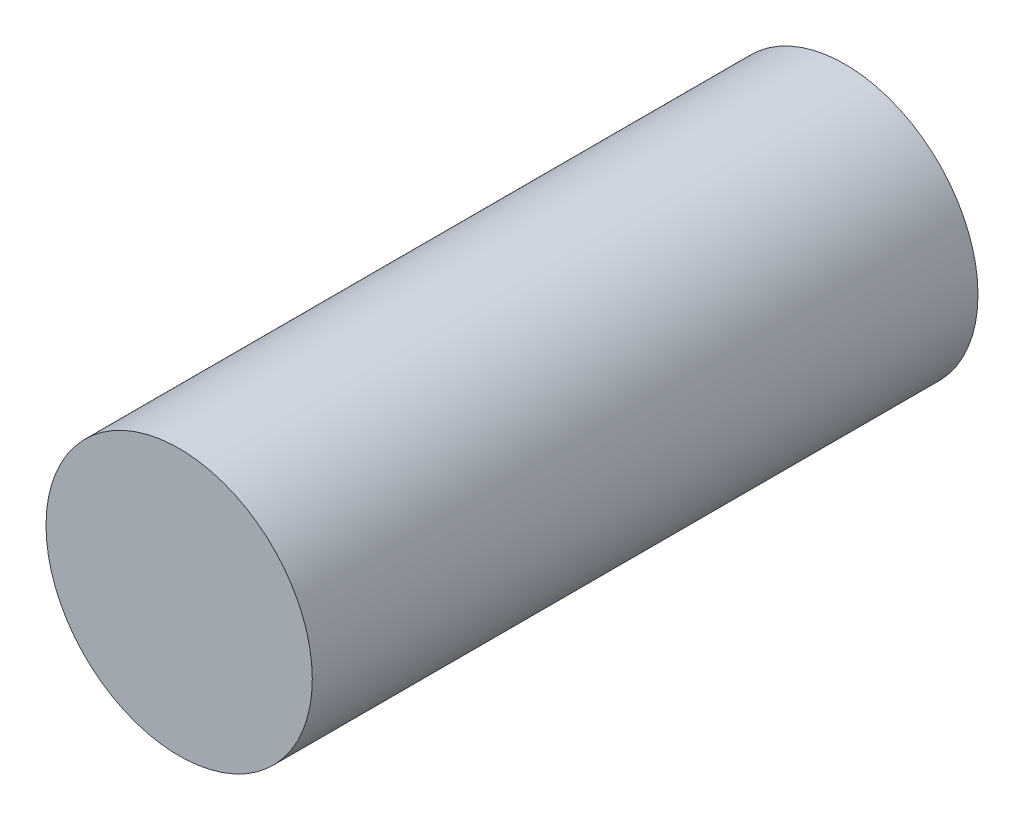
from build123d import *

# Parameters (mm, degrees)
EXTRUDE1_DEPTH      = 38.1
EXTRUDE1_DEPTH_BACK = 25.4
SKETCH2_R           = 12.7


with BuildPart() as part:
    # Sketch2 → Extrude1 (new, two sides: drawn at the far end of the back side and taken through both)
    with BuildSketch(Plane.XY.offset(-EXTRUDE1_DEPTH_BACK)):
        with Locations(Location((0, 0, 0), (0, 0, 180))):
            Circle(SKETCH2_R)
    extrude(amount=EXTRUDE1_DEPTH + EXTRUDE1_DEPTH_BACK)


solid = part.part
